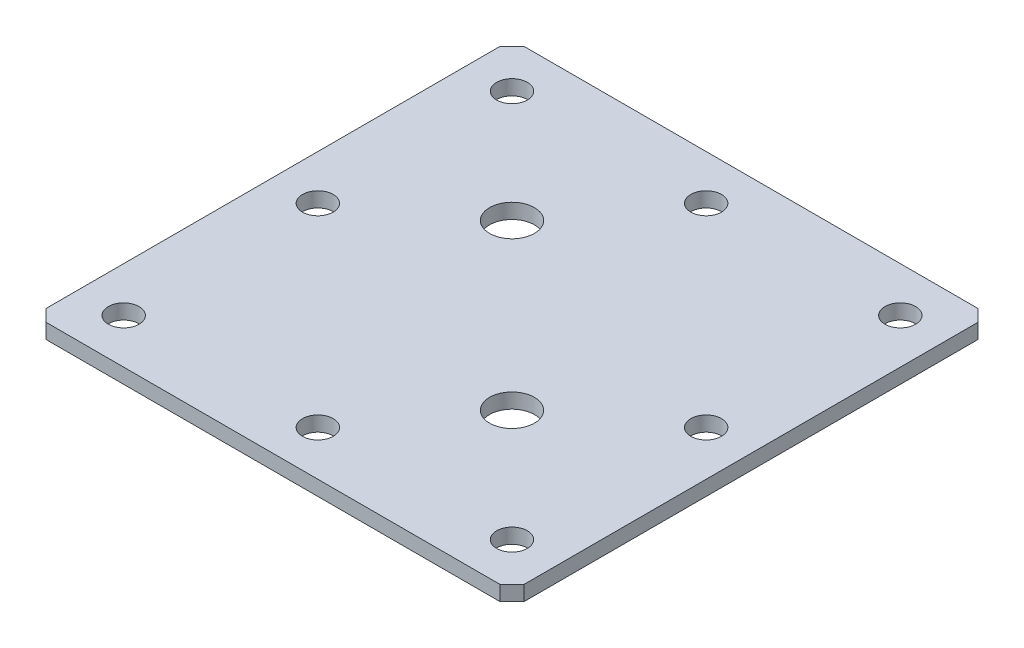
from build123d import *

# Parameters (mm, degrees)
SKETCH1_R           = 3.2639
SKETCH1_R_2         = 4.7625
BOSS_EXTRUDE1_DEPTH = 3.175


with BuildPart() as part:
    # Sketch1 → Boss-Extrude1 (new body)
    with BuildSketch(Plane(origin=(0, 0, 0), x_dir=(1, 0, 0), z_dir=(0, 1, 0))):
        Polygon((-57.410471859, 21.942838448), (-54.870471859, 24.482838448), (41.649528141, 24.482838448), (44.189528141, 21.942838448), (44.189528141, -74.577161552), (41.649528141, -77.117161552), (-54.870471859, -77.117161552), (-57.410471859, -74.577161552), align=None)
        with Locations(Location((-47.885471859, 14.957838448, 0), (0, 0, 270))):
            Circle(SKETCH1_R, mode=Mode.SUBTRACT)
        with Locations(Location((-6.610471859, 14.957838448, 0), (0, 0, 270))):
            Circle(SKETCH1_R, mode=Mode.SUBTRACT)
        with Locations(Location((34.664528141, 14.957838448, 0), (0, 0, 270))):
            Circle(SKETCH1_R, mode=Mode.SUBTRACT)
        with Locations(Location((34.664528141, -26.317161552, 0), (0, 0, 270))):
            Circle(SKETCH1_R, mode=Mode.SUBTRACT)
        with Locations(Location((34.664528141, -67.592161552, 0), (0, 0, 270))):
            Circle(SKETCH1_R, mode=Mode.SUBTRACT)
        with Locations(Location((-6.610471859, -67.592161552, 0), (0, 0, 270))):
            Circle(SKETCH1_R, mode=Mode.SUBTRACT)
        with Locations(Location((-47.885471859, -67.592161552, 0), (0, 0, 270))):
            Circle(SKETCH1_R, mode=Mode.SUBTRACT)
        with Locations(Location((-47.885471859, -26.317161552, 0), (0, 0, 270))):
            Circle(SKETCH1_R, mode=Mode.SUBTRACT)
        with Locations(Location((-24.072971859, -8.854661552, 0), (0, 0, 270))):
            Circle(SKETCH1_R_2, mode=Mode.SUBTRACT)
        with Locations(Location((10.852028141, -43.779661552, 0), (0, 0, 270))):
            Circle(SKETCH1_R_2, mode=Mode.SUBTRACT)
    extrude(amount=BOSS_EXTRUDE1_DEPTH)


solid = part.part
